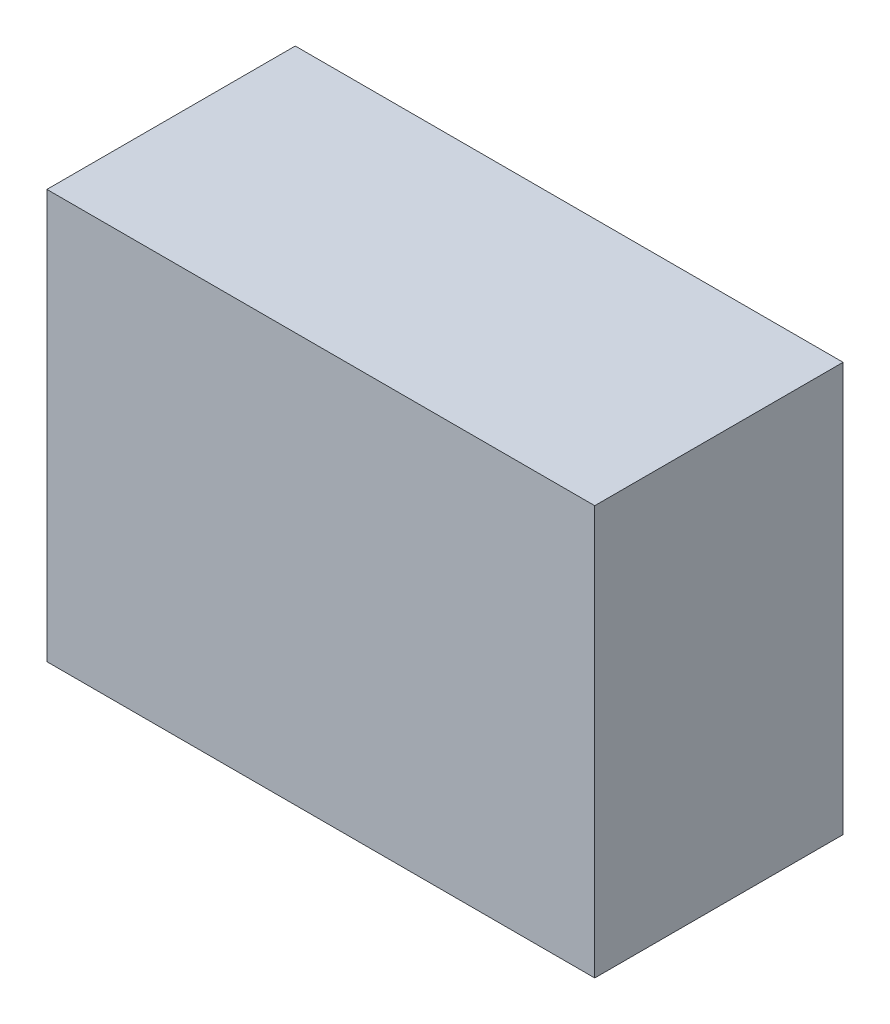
from build123d import *

# Parameters (mm, degrees)
SKETCH1_W           = 95.25
SKETCH1_H           = 71.12
BOSS_EXTRUDE1_DEPTH = 43.18


with BuildPart() as part:
    # Sketch1 → Boss-Extrude1 (new body)
    with BuildSketch(Plane.XY):
        Rectangle(SKETCH1_W, SKETCH1_H)
    extrude(amount=BOSS_EXTRUDE1_DEPTH)


solid = part.part
